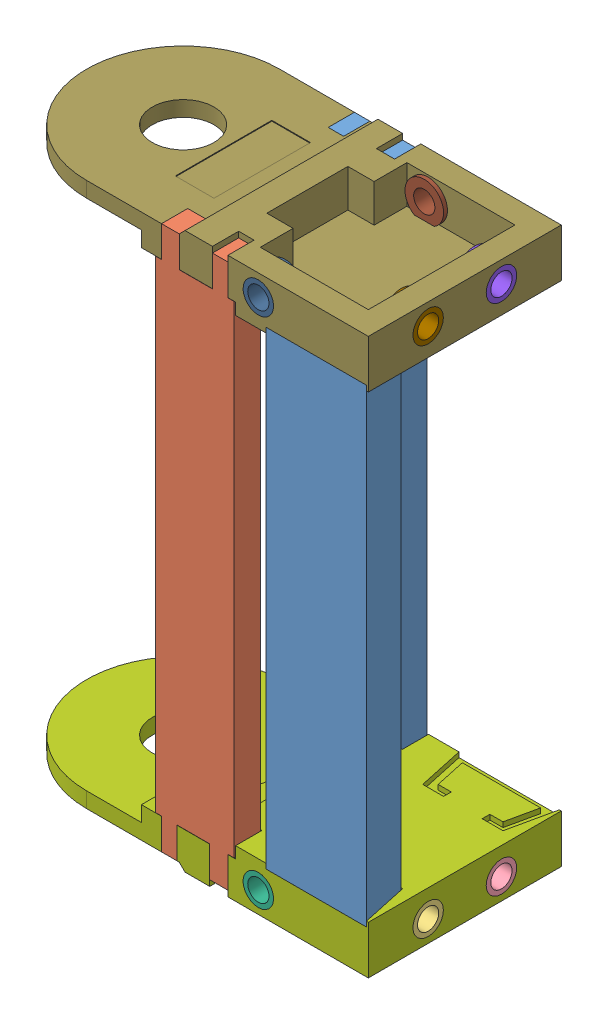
SolidWorks assembly 2700_12_150_ KLM pendelnd.SLDASM, configuration Standard (file format 10000). Lengths in mm.
Overall size (154 144 50).
15 component instances, 13 part files, 2 mates.
Components (placement in the parent):
- 2024_10_24_12_30_43_0442-1: 2024_10_24_12_30_43_0442.sldprt [Standard] at origin size (54.7 141 50)
- 2024_10_24_12_30_43_0426-1: 2024_10_24_12_30_43_0426.sldprt [Standard] at origin size (20.4 141 6.8)
- 2024_10_24_12_30_43_0207-1: 2024_10_24_12_30_43_0207.sldasm [Standard] at origin size (98 12.5 50)
  - 2024_10_24_12_30_43_0411-1: 2024_10_24_12_30_43_0411.sldprt [Standard] at origin size (7 10 10)
  - 2024_10_24_12_30_43_0395-1: 2024_10_24_12_30_43_0395.sldprt [Standard] at origin size (7 10 10)
  - 2024_10_24_12_30_43_0379-1: 2024_10_24_12_30_43_0379.sldprt [Standard] at origin size (10 10 7)
  - 2024_10_24_12_30_43_0364-1: 2024_10_24_12_30_43_0364.sldprt [Standard] at origin size (10 10 7)
  - 2024_10_24_12_30_43_0348-1: 2024_10_24_12_30_43_0348.sldprt [Standard] at origin size (98 12.5 50)
- 2024_10_24_12_30_42_0989-1: 2024_10_24_12_30_42_0989.sldasm [Standard] at origin size (98 12.5 50)
  - 2024_10_24_12_30_43_0192-1: 2024_10_24_12_30_43_0192.sldprt [Standard] at origin size (7 10 10)
  - 2024_10_24_12_30_43_0176-1: 2024_10_24_12_30_43_0176.sldprt [Standard] at origin size (7 10 10)
  - 2024_10_24_12_30_43_0161-1: 2024_10_24_12_30_43_0161.sldprt [Standard] at origin size (10 10 7)
  - 2024_10_24_12_30_43_0145-1: 2024_10_24_12_30_43_0145.sldprt [Standard] at origin size (10 10 7)
  - 2024_10_24_12_30_43_0129-1: 2024_10_24_12_30_43_0129.sldprt [Standard] at origin size (98 12.5 50)
- 2024_10_24_12_30_42_0973-1: 2024_10_24_12_30_42_0973.sldprt [Standard] at origin size (106 141 50)
Mates (geometry in assembly coordinates):
- Konzentrisch1: concentric anti-aligned: cylinder of 2024_10_24_12_30_42_0973-1 through (-156 -6 166) axis (0 -1 0) radius 8; cylinder of 2024_10_24_12_30_43_0207-1/2024_10_24_12_30_43_0348-1 through (-156 64.5 166) axis (0 1 0) radius 8
- Breite2: width aligned: plane of 2024_10_24_12_30_42_0973-1 through (-156 -8 166) normal (0 -1 0); plane of 2024_10_24_12_30_42_0973-1 through (-156 133 166) normal (0 1 0); plane of 2024_10_24_12_30_43_0207-1/2024_10_24_12_30_43_0348-1 through (-156 -8 166) normal (0 -1 0); plane of 2024_10_24_12_30_42_0989-1/2024_10_24_12_30_43_0129-1 through (-156 133 166) normal (0 1 0)
